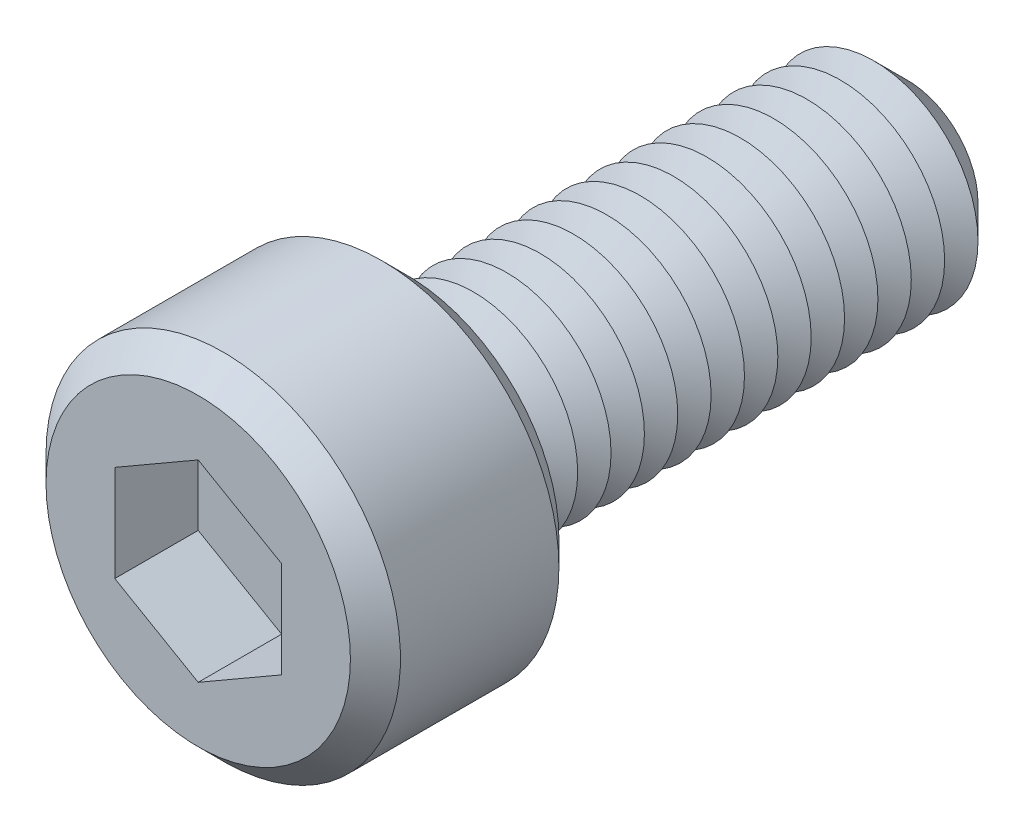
from build123d import *

# Parameters (mm, degrees)
SKETCH1_R           = 4.25
BOSS_EXTRUDE1_DEPTH = 5
SKETCH2_R           = 2.5
BOSS_EXTRUDE2_DEPTH = 12
CHAMFER1_SIZE       = 0.8
LPATTERN1_COUNT     = 14
LPATTERN1_PITCH     = 0.8
CUT_EXTRUDE1_DEPTH  = 2
SKETCH6_R           = 0.65
CUT_EXTRUDE2_DEPTH  = 15
CHAMFER2_SIZE       = 0.6


with BuildPart() as part:
    # Sketch1 → Boss-Extrude1 (new body)
    with BuildSketch(Plane.XY):
        Circle(SKETCH1_R)
    extrude(amount=BOSS_EXTRUDE1_DEPTH)

    # Sketch2 → Boss-Extrude2 (add)
    with BuildSketch(Plane(origin=(0, 0, 0), x_dir=(-1, 0, 0), z_dir=(0, 0, -1))):
        Circle(SKETCH2_R)
    extrude(amount=BOSS_EXTRUDE2_DEPTH)

    # Chamfer1
    chamfer1_edges = [part.edges().sort_by_distance(p)[0] for p in [
        (2.5, 0, -12),
    ]]
    chamfer(chamfer1_edges, length=CHAMFER1_SIZE)

    # Sketch4 → Cut-Revolve1 (revolve, cut)
    with BuildSketch(Plane(origin=(0, 0, 0), x_dir=(0, 0, -1), z_dir=(1, 0, 0)), mode=Mode.PRIVATE) as cut_revolve1_sk:
        Polygon((0, 2.5), (0.4, 1.807179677), (0.8, 2.5), align=None)
    cut_revolve1 = revolve(cut_revolve1_sk.sketch.rotate(Axis((0, 0, 2.512122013), (0, 0, -1)), 90), axis=Axis((0, 0, 2.512122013), (0, 0, -1)), mode=Mode.SUBTRACT)

    # LPattern1: Cut-Revolve1 ×14
    with Locations(*[(0, 0, -i * LPATTERN1_PITCH) for i in range(1, LPATTERN1_COUNT)]):
        add(cut_revolve1, mode=Mode.SUBTRACT)

    # Sketch5 → Cut-Extrude1 (cut)
    with BuildSketch(Plane.XY.offset(5)):
        Polygon((0, 2.309401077), (-2, 1.154700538), (-2, -1.154700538), (0, -2.309401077), (2, -1.154700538), (2, 1.154700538), align=None)
    extrude(amount=-CUT_EXTRUDE1_DEPTH, mode=Mode.SUBTRACT)

    # Sketch6 → Cut-Extrude2 (cut)
    with BuildSketch(Plane.XY.offset(3)):
        Circle(SKETCH6_R)
    extrude(amount=-CUT_EXTRUDE2_DEPTH, mode=Mode.SUBTRACT)

    # Chamfer2
    chamfer2_edges = [part.edges().sort_by_distance(p)[0] for p in [
        (-4.25, 0, 0),
        (-4.25, 0, 5),
    ]]
    chamfer(chamfer2_edges, length=CHAMFER2_SIZE)


solid = part.part
